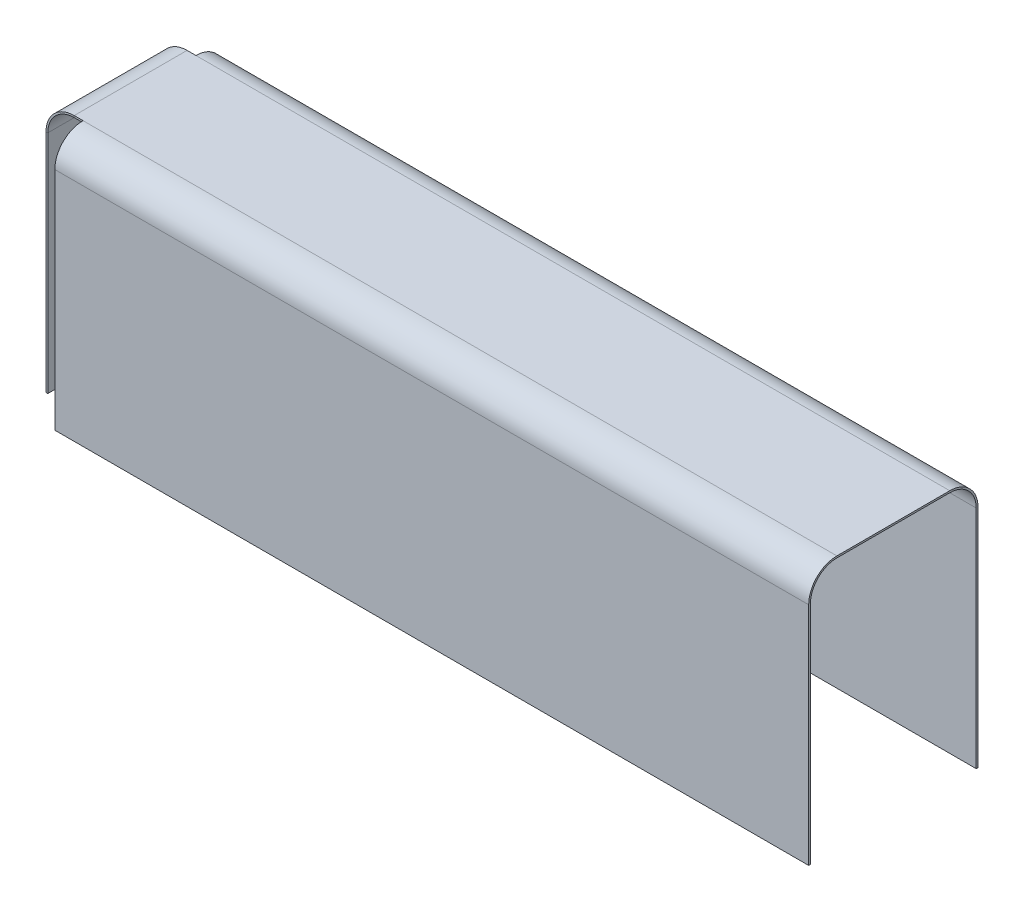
ISO-10303-21;
HEADER;
FILE_DESCRIPTION(('STEP AP214'),'2;1');
FILE_NAME('part.step','',(''),(''),'','','');
FILE_SCHEMA(('AUTOMOTIVE_DESIGN { 1 0 10303 214 1 1 1 1 }'));
ENDSEC;
DATA;
#1=APPLICATION_CONTEXT('core data for automotive mechanical design processes');
#2=APPLICATION_PROTOCOL_DEFINITION('international standard','automotive_design',2000,#1);
#3=PRODUCT_CONTEXT('',#1,'mechanical');
#4=PRODUCT('Part','Part','',(#3));
#5=PRODUCT_RELATED_PRODUCT_CATEGORY('part','',(#4));
#6=PRODUCT_DEFINITION_FORMATION('','',#4);
#7=PRODUCT_DEFINITION_CONTEXT('part definition',#1,'design');
#8=PRODUCT_DEFINITION('design','',#6,#7);
#9=PRODUCT_DEFINITION_SHAPE('','',#8);
#10=(LENGTH_UNIT() NAMED_UNIT(*) SI_UNIT(.MILLI.,.METRE.));
#11=(NAMED_UNIT(*) PLANE_ANGLE_UNIT() SI_UNIT($,.RADIAN.));
#12=(NAMED_UNIT(*) SI_UNIT($,.STERADIAN.) SOLID_ANGLE_UNIT());
#13=UNCERTAINTY_MEASURE_WITH_UNIT(LENGTH_MEASURE(1.E-05),#10,'distance_accuracy_value','');
#14=(GEOMETRIC_REPRESENTATION_CONTEXT(3) GLOBAL_UNCERTAINTY_ASSIGNED_CONTEXT((#13)) GLOBAL_UNIT_ASSIGNED_CONTEXT((#10,
#11,#12)) REPRESENTATION_CONTEXT('',''));
#15=CARTESIAN_POINT('',(0.,0.,0.));
#16=DIRECTION('',(0.,0.,1.));
#17=DIRECTION('',(1.,0.,0.));
#18=AXIS2_PLACEMENT_3D('',#15,#16,#17);
#19=CARTESIAN_POINT('',(-169.630725,114.3,38.1));
#20=DIRECTION('',(1.,0.,0.));
#21=DIRECTION('',(0.,0.,-1.));
#22=AXIS2_PLACEMENT_3D('',#19,#20,#21);
#23=PLANE('',#22);
#24=DIRECTION('',(0.,-1.,0.));
#25=VECTOR('',#24,1.);
#26=CARTESIAN_POINT('',(-169.630725,114.3,-25.4));
#27=LINE('',#26,#25);
#28=CARTESIAN_POINT('',(-169.630725,114.3,-25.4));
#29=VERTEX_POINT('',#28);
#30=CARTESIAN_POINT('',(-169.630725,113.50625,-25.4));
#31=VERTEX_POINT('',#30);
#32=EDGE_CURVE('E198',#29,#31,#27,.T.);
#33=ORIENTED_EDGE('',*,*,#32,.F.);
#34=CARTESIAN_POINT('',(-169.630725,101.6,-25.4));
#35=DIRECTION('',(1.,0.,0.));
#36=DIRECTION('',(0.,0.,-1.));
#37=AXIS2_PLACEMENT_3D('',#34,#35,#36);
#38=CIRCLE('',#37,12.7);
#39=CARTESIAN_POINT('',(-169.630725,101.6,-38.1));
#40=VERTEX_POINT('',#39);
#41=EDGE_CURVE('E315',#29,#40,#38,.F.);
#42=ORIENTED_EDGE('',*,*,#41,.T.);
#43=DIRECTION('',(0.,-1.,0.));
#44=VECTOR('',#43,1.);
#45=CARTESIAN_POINT('',(-169.630725,114.3,-38.1));
#46=LINE('',#45,#44);
#47=CARTESIAN_POINT('',(-169.630725,0.,-38.1));
#48=VERTEX_POINT('',#47);
#49=EDGE_CURVE('E285',#40,#48,#46,.T.);
#50=ORIENTED_EDGE('',*,*,#49,.T.);
#51=DIRECTION('',(0.,0.,1.));
#52=VECTOR('',#51,1.);
#53=CARTESIAN_POINT('',(-169.630725,0.,38.1));
#54=LINE('',#53,#52);
#55=CARTESIAN_POINT('',(-169.630725,0.,-37.30625));
#56=VERTEX_POINT('',#55);
#57=EDGE_CURVE('E287',#48,#56,#54,.T.);
#58=ORIENTED_EDGE('',*,*,#57,.T.);
#59=DIRECTION('',(0.,-1.,0.));
#60=VECTOR('',#59,1.);
#61=CARTESIAN_POINT('',(-169.630725,114.3,-37.30625));
#62=LINE('',#61,#60);
#63=CARTESIAN_POINT('',(-169.630725,101.6,-37.30625));
#64=VERTEX_POINT('',#63);
#65=EDGE_CURVE('E272',#64,#56,#62,.T.);
#66=ORIENTED_EDGE('',*,*,#65,.F.);
#67=CARTESIAN_POINT('',(-169.630725,101.6,-25.4));
#68=DIRECTION('',(1.,0.,0.));
#69=DIRECTION('',(0.,0.,-1.));
#70=AXIS2_PLACEMENT_3D('',#67,#68,#69);
#71=CIRCLE('',#70,11.90625);
#72=EDGE_CURVE('E262',#31,#64,#71,.F.);
#73=ORIENTED_EDGE('',*,*,#72,.F.);
#74=EDGE_LOOP('',(#33,#42,#50,#58,#66,#73));
#75=FACE_BOUND('',#74,.T.);
#76=ADVANCED_FACE('F33',(#75),#23,.F.);
#77=DIRECTION('',(0.,1.,0.));
#78=VECTOR('',#77,1.);
#79=CARTESIAN_POINT('',(-169.630725,114.3,25.4));
#80=LINE('',#79,#78);
#81=CARTESIAN_POINT('',(-169.630725,113.50625,25.4));
#82=VERTEX_POINT('',#81);
#83=CARTESIAN_POINT('',(-169.630725,114.3,25.4));
#84=VERTEX_POINT('',#83);
#85=EDGE_CURVE('E195',#82,#84,#80,.T.);
#86=ORIENTED_EDGE('',*,*,#85,.F.);
#87=CARTESIAN_POINT('',(-169.630725,101.6,25.4));
#88=DIRECTION('',(1.,0.,0.));
#89=DIRECTION('',(0.,0.,-1.));
#90=AXIS2_PLACEMENT_3D('',#87,#88,#89);
#91=CIRCLE('',#90,11.90625);
#92=CARTESIAN_POINT('',(-169.630725,101.6,37.30625));
#93=VERTEX_POINT('',#92);
#94=EDGE_CURVE('E258',#93,#82,#91,.F.);
#95=ORIENTED_EDGE('',*,*,#94,.F.);
#96=DIRECTION('',(0.,-1.,0.));
#97=VECTOR('',#96,1.);
#98=CARTESIAN_POINT('',(-169.630725,114.3,37.30625));
#99=LINE('',#98,#97);
#100=CARTESIAN_POINT('',(-169.630725,0.,37.30625));
#101=VERTEX_POINT('',#100);
#102=EDGE_CURVE('E256',#93,#101,#99,.T.);
#103=ORIENTED_EDGE('',*,*,#102,.T.);
#104=CARTESIAN_POINT('',(-169.630725,0.,38.1));
#105=VERTEX_POINT('',#104);
#106=EDGE_CURVE('E251',#101,#105,#54,.T.);
#107=ORIENTED_EDGE('',*,*,#106,.T.);
#108=DIRECTION('',(0.,-1.,0.));
#109=VECTOR('',#108,1.);
#110=CARTESIAN_POINT('',(-169.630725,114.3,38.1));
#111=LINE('',#110,#109);
#112=CARTESIAN_POINT('',(-169.630725,101.6,38.1));
#113=VERTEX_POINT('',#112);
#114=EDGE_CURVE('E305',#113,#105,#111,.T.);
#115=ORIENTED_EDGE('',*,*,#114,.F.);
#116=CARTESIAN_POINT('',(-169.630725,101.6,25.4));
#117=DIRECTION('',(1.,0.,0.));
#118=DIRECTION('',(0.,0.,-1.));
#119=AXIS2_PLACEMENT_3D('',#116,#117,#118);
#120=CIRCLE('',#119,12.7);
#121=EDGE_CURVE('E312',#113,#84,#120,.F.);
#122=ORIENTED_EDGE('',*,*,#121,.T.);
#123=EDGE_LOOP('',(#86,#95,#103,#107,#115,#122));
#124=FACE_BOUND('',#123,.T.);
#125=ADVANCED_FACE('F358',(#124),#23,.F.);
#126=CARTESIAN_POINT('',(0.,0.,0.));
#127=DIRECTION('',(0.,-1.,0.));
#128=DIRECTION('',(0.,0.,-1.));
#129=AXIS2_PLACEMENT_3D('',#126,#127,#128);
#130=PLANE('',#129);
#131=DIRECTION('',(0.,0.,-1.));
#132=VECTOR('',#131,1.);
#133=CARTESIAN_POINT('',(169.630725,0.,38.1));
#134=LINE('',#133,#132);
#135=CARTESIAN_POINT('',(169.630725,0.,-37.30625));
#136=VERTEX_POINT('',#135);
#137=CARTESIAN_POINT('',(169.630725,0.,-38.1));
#138=VERTEX_POINT('',#137);
#139=EDGE_CURVE('E293',#136,#138,#134,.T.);
#140=ORIENTED_EDGE('',*,*,#139,.F.);
#141=DIRECTION('',(-1.,0.,0.));
#142=VECTOR('',#141,1.);
#143=CARTESIAN_POINT('',(0.,0.,-37.30625));
#144=LINE('',#143,#142);
#145=EDGE_CURVE('E266',#136,#56,#144,.T.);
#146=ORIENTED_EDGE('',*,*,#145,.T.);
#147=ORIENTED_EDGE('',*,*,#57,.F.);
#148=DIRECTION('',(-1.,0.,0.));
#149=VECTOR('',#148,1.);
#150=CARTESIAN_POINT('',(-169.630725,0.,-38.1));
#151=LINE('',#150,#149);
#152=EDGE_CURVE('E286',#138,#48,#151,.T.);
#153=ORIENTED_EDGE('',*,*,#152,.F.);
#154=EDGE_LOOP('',(#140,#146,#147,#153));
#155=FACE_BOUND('',#154,.T.);
#156=ADVANCED_FACE('F336',(#155),#130,.T.);
#157=ORIENTED_EDGE('',*,*,#106,.F.);
#158=DIRECTION('',(1.,0.,0.));
#159=VECTOR('',#158,1.);
#160=CARTESIAN_POINT('',(0.,0.,37.30625));
#161=LINE('',#160,#159);
#162=CARTESIAN_POINT('',(169.630725,0.,37.30625));
#163=VERTEX_POINT('',#162);
#164=EDGE_CURVE('E248',#101,#163,#161,.T.);
#165=ORIENTED_EDGE('',*,*,#164,.T.);
#166=CARTESIAN_POINT('',(169.630725,0.,38.1));
#167=VERTEX_POINT('',#166);
#168=EDGE_CURVE('E294',#167,#163,#134,.T.);
#169=ORIENTED_EDGE('',*,*,#168,.F.);
#170=DIRECTION('',(1.,0.,0.));
#171=VECTOR('',#170,1.);
#172=CARTESIAN_POINT('',(-169.630725,0.,38.1));
#173=LINE('',#172,#171);
#174=EDGE_CURVE('E290',#105,#167,#173,.T.);
#175=ORIENTED_EDGE('',*,*,#174,.F.);
#176=EDGE_LOOP('',(#157,#165,#169,#175));
#177=FACE_BOUND('',#176,.T.);
#178=ADVANCED_FACE('F419',(#177),#130,.T.);
#179=CARTESIAN_POINT('',(-169.630725,114.3,38.1));
#180=DIRECTION('',(0.,0.,-1.));
#181=DIRECTION('',(-1.,0.,0.));
#182=AXIS2_PLACEMENT_3D('',#179,#180,#181);
#183=PLANE('',#182);
#184=DIRECTION('',(0.,-1.,0.));
#185=VECTOR('',#184,1.);
#186=CARTESIAN_POINT('',(169.630725,114.3,38.1));
#187=LINE('',#186,#185);
#188=CARTESIAN_POINT('',(169.630725,101.6,38.1));
#189=VERTEX_POINT('',#188);
#190=EDGE_CURVE('E303',#189,#167,#187,.T.);
#191=ORIENTED_EDGE('',*,*,#190,.F.);
#192=DIRECTION('',(1.,0.,0.));
#193=VECTOR('',#192,1.);
#194=CARTESIAN_POINT('',(-169.630725,101.6,38.1));
#195=LINE('',#194,#193);
#196=EDGE_CURVE('E11',#189,#113,#195,.F.);
#197=ORIENTED_EDGE('',*,*,#196,.T.);
#198=ORIENTED_EDGE('',*,*,#114,.T.);
#199=ORIENTED_EDGE('',*,*,#174,.T.);
#200=EDGE_LOOP('',(#191,#197,#198,#199));
#201=FACE_BOUND('',#200,.T.);
#202=ADVANCED_FACE('F403',(#201),#183,.F.);
#203=CARTESIAN_POINT('',(169.630725,114.3,38.1));
#204=DIRECTION('',(-1.,0.,0.));
#205=DIRECTION('',(0.,0.,1.));
#206=AXIS2_PLACEMENT_3D('',#203,#204,#205);
#207=PLANE('',#206);
#208=CARTESIAN_POINT('',(169.630725,101.6,-25.4));
#209=DIRECTION('',(-1.,0.,0.));
#210=DIRECTION('',(0.,0.,1.));
#211=AXIS2_PLACEMENT_3D('',#208,#209,#210);
#212=CIRCLE('',#211,11.90625);
#213=CARTESIAN_POINT('',(169.630725,101.6,-37.30625));
#214=VERTEX_POINT('',#213);
#215=CARTESIAN_POINT('',(169.630725,113.50625,-25.4));
#216=VERTEX_POINT('',#215);
#217=EDGE_CURVE('E252',#214,#216,#212,.F.);
#218=ORIENTED_EDGE('',*,*,#217,.F.);
#219=DIRECTION('',(0.,-1.,0.));
#220=VECTOR('',#219,1.);
#221=CARTESIAN_POINT('',(169.630725,114.3,-37.30625));
#222=LINE('',#221,#220);
#223=EDGE_CURVE('E264',#214,#136,#222,.T.);
#224=ORIENTED_EDGE('',*,*,#223,.T.);
#225=ORIENTED_EDGE('',*,*,#139,.T.);
#226=DIRECTION('',(0.,-1.,0.));
#227=VECTOR('',#226,1.);
#228=CARTESIAN_POINT('',(169.630725,114.3,-38.1));
#229=LINE('',#228,#227);
#230=CARTESIAN_POINT('',(169.630725,101.6,-38.1));
#231=VERTEX_POINT('',#230);
#232=EDGE_CURVE('E300',#231,#138,#229,.T.);
#233=ORIENTED_EDGE('',*,*,#232,.F.);
#234=CARTESIAN_POINT('',(169.630725,101.6,-25.4));
#235=DIRECTION('',(-1.,0.,0.));
#236=DIRECTION('',(0.,0.,1.));
#237=AXIS2_PLACEMENT_3D('',#234,#235,#236);
#238=CIRCLE('',#237,12.7);
#239=CARTESIAN_POINT('',(169.630725,114.3,-25.4));
#240=VERTEX_POINT('',#239);
#241=EDGE_CURVE('E41',#231,#240,#238,.F.);
#242=ORIENTED_EDGE('',*,*,#241,.T.);
#243=DIRECTION('',(0.,0.,-1.));
#244=VECTOR('',#243,1.);
#245=CARTESIAN_POINT('',(169.630725,114.3,38.1));
#246=LINE('',#245,#244);
#247=CARTESIAN_POINT('',(169.630725,114.3,25.4));
#248=VERTEX_POINT('',#247);
#249=EDGE_CURVE('E283',#248,#240,#246,.T.);
#250=ORIENTED_EDGE('',*,*,#249,.F.);
#251=CARTESIAN_POINT('',(169.630725,101.6,25.4));
#252=DIRECTION('',(-1.,0.,0.));
#253=DIRECTION('',(0.,0.,1.));
#254=AXIS2_PLACEMENT_3D('',#251,#252,#253);
#255=CIRCLE('',#254,12.7);
#256=EDGE_CURVE('E56',#248,#189,#255,.F.);
#257=ORIENTED_EDGE('',*,*,#256,.T.);
#258=ORIENTED_EDGE('',*,*,#190,.T.);
#259=ORIENTED_EDGE('',*,*,#168,.T.);
#260=DIRECTION('',(0.,-1.,0.));
#261=VECTOR('',#260,1.);
#262=CARTESIAN_POINT('',(169.630725,114.3,37.30625));
#263=LINE('',#262,#261);
#264=CARTESIAN_POINT('',(169.630725,101.6,37.30625));
#265=VERTEX_POINT('',#264);
#266=EDGE_CURVE('E48',#265,#163,#263,.T.);
#267=ORIENTED_EDGE('',*,*,#266,.F.);
#268=CARTESIAN_POINT('',(169.630725,101.6,25.4));
#269=DIRECTION('',(-1.,0.,0.));
#270=DIRECTION('',(0.,0.,1.));
#271=AXIS2_PLACEMENT_3D('',#268,#269,#270);
#272=CIRCLE('',#271,11.90625);
#273=CARTESIAN_POINT('',(169.630725,113.50625,25.4));
#274=VERTEX_POINT('',#273);
#275=EDGE_CURVE('E261',#274,#265,#272,.F.);
#276=ORIENTED_EDGE('',*,*,#275,.F.);
#277=DIRECTION('',(0.,0.,-1.));
#278=VECTOR('',#277,1.);
#279=CARTESIAN_POINT('',(169.630725,113.50625,0.));
#280=LINE('',#279,#278);
#281=EDGE_CURVE('E274',#274,#216,#280,.T.);
#282=ORIENTED_EDGE('',*,*,#281,.T.);
#283=EDGE_LOOP('',(#218,#224,#225,#233,#242,#250,#257,#258,#259,#267,#276,#282));
#284=FACE_BOUND('',#283,.T.);
#285=ADVANCED_FACE('F322',(#284),#207,.F.);
#286=CARTESIAN_POINT('',(-169.630725,114.3,-38.1));
#287=DIRECTION('',(0.,0.,1.));
#288=DIRECTION('',(1.,0.,0.));
#289=AXIS2_PLACEMENT_3D('',#286,#287,#288);
#290=PLANE('',#289);
#291=ORIENTED_EDGE('',*,*,#49,.F.);
#292=DIRECTION('',(-1.,0.,0.));
#293=VECTOR('',#292,1.);
#294=CARTESIAN_POINT('',(-169.630725,101.6,-38.1));
#295=LINE('',#294,#293);
#296=EDGE_CURVE('E317',#40,#231,#295,.F.);
#297=ORIENTED_EDGE('',*,*,#296,.T.);
#298=ORIENTED_EDGE('',*,*,#232,.T.);
#299=ORIENTED_EDGE('',*,*,#152,.T.);
#300=EDGE_LOOP('',(#291,#297,#298,#299));
#301=FACE_BOUND('',#300,.T.);
#302=ADVANCED_FACE('F331',(#301),#290,.F.);
#303=CARTESIAN_POINT('',(0.,114.3,0.));
#304=DIRECTION('',(0.,-1.,0.));
#305=DIRECTION('',(0.,0.,-1.));
#306=AXIS2_PLACEMENT_3D('',#303,#304,#305);
#307=PLANE('',#306);
#308=ORIENTED_EDGE('',*,*,#249,.T.);
#309=DIRECTION('',(-1.,0.,0.));
#310=VECTOR('',#309,1.);
#311=CARTESIAN_POINT('',(0.,114.3,-25.4));
#312=LINE('',#311,#310);
#313=EDGE_CURVE('E194',#240,#29,#312,.T.);
#314=ORIENTED_EDGE('',*,*,#313,.T.);
#315=DIRECTION('',(-1.,0.,0.));
#316=VECTOR('',#315,1.);
#317=CARTESIAN_POINT('',(-169.630725,114.3,-25.4));
#318=LINE('',#317,#316);
#319=CARTESIAN_POINT('',(-173.599475,114.3,-25.4));
#320=VERTEX_POINT('',#319);
#321=EDGE_CURVE('E186',#29,#320,#318,.T.);
#322=ORIENTED_EDGE('',*,*,#321,.T.);
#323=DIRECTION('',(0.,0.,-1.));
#324=VECTOR('',#323,1.);
#325=CARTESIAN_POINT('',(-173.599475,114.3,-25.4));
#326=LINE('',#325,#324);
#327=CARTESIAN_POINT('',(-173.599475,114.3,25.4));
#328=VERTEX_POINT('',#327);
#329=EDGE_CURVE('E169',#328,#320,#326,.T.);
#330=ORIENTED_EDGE('',*,*,#329,.F.);
#331=DIRECTION('',(-1.,0.,0.));
#332=VECTOR('',#331,1.);
#333=CARTESIAN_POINT('',(-169.630725,114.3,25.4));
#334=LINE('',#333,#332);
#335=EDGE_CURVE('E179',#84,#328,#334,.T.);
#336=ORIENTED_EDGE('',*,*,#335,.F.);
#337=DIRECTION('',(1.,0.,0.));
#338=VECTOR('',#337,1.);
#339=CARTESIAN_POINT('',(0.,114.3,25.4));
#340=LINE('',#339,#338);
#341=EDGE_CURVE('E308',#84,#248,#340,.T.);
#342=ORIENTED_EDGE('',*,*,#341,.T.);
#343=EDGE_LOOP('',(#308,#314,#322,#330,#336,#342));
#344=FACE_BOUND('',#343,.T.);
#345=ADVANCED_FACE('F192',(#344),#307,.F.);
#346=CARTESIAN_POINT('',(0.,101.6,-25.4));
#347=DIRECTION('',(-1.,0.,0.));
#348=DIRECTION('',(0.,0.,1.));
#349=AXIS2_PLACEMENT_3D('',#346,#347,#348);
#350=CYLINDRICAL_SURFACE('',#349,12.7);
#351=ORIENTED_EDGE('',*,*,#241,.F.);
#352=ORIENTED_EDGE('',*,*,#296,.F.);
#353=ORIENTED_EDGE('',*,*,#41,.F.);
#354=ORIENTED_EDGE('',*,*,#313,.F.);
#355=EDGE_LOOP('',(#351,#352,#353,#354));
#356=FACE_BOUND('',#355,.T.);
#357=ADVANCED_FACE('F326',(#356),#350,.T.);
#358=CARTESIAN_POINT('',(0.,101.6,25.4));
#359=DIRECTION('',(1.,0.,0.));
#360=DIRECTION('',(0.,0.,-1.));
#361=AXIS2_PLACEMENT_3D('',#358,#359,#360);
#362=CYLINDRICAL_SURFACE('',#361,12.7);
#363=ORIENTED_EDGE('',*,*,#121,.F.);
#364=ORIENTED_EDGE('',*,*,#196,.F.);
#365=ORIENTED_EDGE('',*,*,#256,.F.);
#366=ORIENTED_EDGE('',*,*,#341,.F.);
#367=EDGE_LOOP('',(#363,#364,#365,#366));
#368=FACE_BOUND('',#367,.T.);
#369=ADVANCED_FACE('F35',(#368),#362,.T.);
#370=CARTESIAN_POINT('',(-169.630725,114.3,37.30625));
#371=DIRECTION('',(0.,0.,-1.));
#372=DIRECTION('',(-1.,0.,0.));
#373=AXIS2_PLACEMENT_3D('',#370,#371,#372);
#374=PLANE('',#373);
#375=ORIENTED_EDGE('',*,*,#266,.T.);
#376=ORIENTED_EDGE('',*,*,#164,.F.);
#377=ORIENTED_EDGE('',*,*,#102,.F.);
#378=DIRECTION('',(-1.,0.,0.));
#379=VECTOR('',#378,1.);
#380=CARTESIAN_POINT('',(-169.630725,101.6,37.30625));
#381=LINE('',#380,#379);
#382=EDGE_CURVE('E249',#265,#93,#381,.T.);
#383=ORIENTED_EDGE('',*,*,#382,.F.);
#384=EDGE_LOOP('',(#375,#376,#377,#383));
#385=FACE_BOUND('',#384,.T.);
#386=ADVANCED_FACE('F354',(#385),#374,.T.);
#387=CARTESIAN_POINT('',(-169.630725,114.3,-37.30625));
#388=DIRECTION('',(0.,0.,1.));
#389=DIRECTION('',(1.,0.,0.));
#390=AXIS2_PLACEMENT_3D('',#387,#388,#389);
#391=PLANE('',#390);
#392=ORIENTED_EDGE('',*,*,#65,.T.);
#393=ORIENTED_EDGE('',*,*,#145,.F.);
#394=ORIENTED_EDGE('',*,*,#223,.F.);
#395=DIRECTION('',(1.,0.,0.));
#396=VECTOR('',#395,1.);
#397=CARTESIAN_POINT('',(-169.630725,101.6,-37.30625));
#398=LINE('',#397,#396);
#399=EDGE_CURVE('E259',#64,#214,#398,.T.);
#400=ORIENTED_EDGE('',*,*,#399,.F.);
#401=EDGE_LOOP('',(#392,#393,#394,#400));
#402=FACE_BOUND('',#401,.T.);
#403=ADVANCED_FACE('F340',(#402),#391,.T.);
#404=CARTESIAN_POINT('',(0.,113.50625,0.));
#405=DIRECTION('',(0.,-1.,0.));
#406=DIRECTION('',(0.,0.,-1.));
#407=AXIS2_PLACEMENT_3D('',#404,#405,#406);
#408=PLANE('',#407);
#409=ORIENTED_EDGE('',*,*,#281,.F.);
#410=DIRECTION('',(1.,0.,0.));
#411=VECTOR('',#410,1.);
#412=CARTESIAN_POINT('',(0.,113.50625,25.4));
#413=LINE('',#412,#411);
#414=EDGE_CURVE('E253',#82,#274,#413,.T.);
#415=ORIENTED_EDGE('',*,*,#414,.F.);
#416=DIRECTION('',(-1.,0.,0.));
#417=VECTOR('',#416,1.);
#418=CARTESIAN_POINT('',(-169.630725,113.50625,25.4));
#419=LINE('',#418,#417);
#420=CARTESIAN_POINT('',(-173.599475,113.50625,25.4));
#421=VERTEX_POINT('',#420);
#422=EDGE_CURVE('E219',#82,#421,#419,.T.);
#423=ORIENTED_EDGE('',*,*,#422,.T.);
#424=DIRECTION('',(0.,0.,1.));
#425=VECTOR('',#424,1.);
#426=CARTESIAN_POINT('',(-173.599475,113.50625,-25.4));
#427=LINE('',#426,#425);
#428=CARTESIAN_POINT('',(-173.599475,113.50625,-25.4));
#429=VERTEX_POINT('',#428);
#430=EDGE_CURVE('E216',#429,#421,#427,.T.);
#431=ORIENTED_EDGE('',*,*,#430,.F.);
#432=DIRECTION('',(-1.,0.,0.));
#433=VECTOR('',#432,1.);
#434=CARTESIAN_POINT('',(-169.630725,113.50625,-25.4));
#435=LINE('',#434,#433);
#436=EDGE_CURVE('E188',#31,#429,#435,.T.);
#437=ORIENTED_EDGE('',*,*,#436,.F.);
#438=DIRECTION('',(1.,0.,0.));
#439=VECTOR('',#438,1.);
#440=CARTESIAN_POINT('',(0.,113.50625,-25.4));
#441=LINE('',#440,#439);
#442=EDGE_CURVE('E255',#216,#31,#441,.F.);
#443=ORIENTED_EDGE('',*,*,#442,.F.);
#444=EDGE_LOOP('',(#409,#415,#423,#431,#437,#443));
#445=FACE_BOUND('',#444,.T.);
#446=ADVANCED_FACE('F347',(#445),#408,.T.);
#447=CARTESIAN_POINT('',(0.,101.6,-25.4));
#448=DIRECTION('',(-1.,0.,0.));
#449=DIRECTION('',(0.,0.,1.));
#450=AXIS2_PLACEMENT_3D('',#447,#448,#449);
#451=CYLINDRICAL_SURFACE('',#450,11.90625);
#452=ORIENTED_EDGE('',*,*,#217,.T.);
#453=ORIENTED_EDGE('',*,*,#442,.T.);
#454=ORIENTED_EDGE('',*,*,#72,.T.);
#455=ORIENTED_EDGE('',*,*,#399,.T.);
#456=EDGE_LOOP('',(#452,#453,#454,#455));
#457=FACE_BOUND('',#456,.T.);
#458=ADVANCED_FACE('F343',(#457),#451,.F.);
#459=CARTESIAN_POINT('',(0.,101.6,25.4));
#460=DIRECTION('',(1.,0.,0.));
#461=DIRECTION('',(0.,0.,-1.));
#462=AXIS2_PLACEMENT_3D('',#459,#460,#461);
#463=CYLINDRICAL_SURFACE('',#462,11.90625);
#464=ORIENTED_EDGE('',*,*,#94,.T.);
#465=ORIENTED_EDGE('',*,*,#414,.T.);
#466=ORIENTED_EDGE('',*,*,#275,.T.);
#467=ORIENTED_EDGE('',*,*,#382,.T.);
#468=EDGE_LOOP('',(#464,#465,#466,#467));
#469=FACE_BOUND('',#468,.T.);
#470=ADVANCED_FACE('F352',(#469),#463,.F.);
#471=CARTESIAN_POINT('',(-71.999475,8.04911692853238E-13,0.));
#472=DIRECTION('',(0.,-1.,0.));
#473=DIRECTION('',(0.,0.,1.));
#474=AXIS2_PLACEMENT_3D('',#471,#472,#473);
#475=PLANE('',#474);
#476=DIRECTION('',(1.,0.,0.));
#477=VECTOR('',#476,1.);
#478=CARTESIAN_POINT('',(-186.299475,0.,-25.4));
#479=LINE('',#478,#477);
#480=CARTESIAN_POINT('',(-186.299475,0.,-25.4));
#481=VERTEX_POINT('',#480);
#482=CARTESIAN_POINT('',(-185.505725,0.,-25.4));
#483=VERTEX_POINT('',#482);
#484=EDGE_CURVE('E206',#481,#483,#479,.T.);
#485=ORIENTED_EDGE('',*,*,#484,.T.);
#486=DIRECTION('',(0.,0.,1.));
#487=VECTOR('',#486,1.);
#488=CARTESIAN_POINT('',(-185.505725,0.,-25.4));
#489=LINE('',#488,#487);
#490=CARTESIAN_POINT('',(-185.505725,0.,25.4));
#491=VERTEX_POINT('',#490);
#492=EDGE_CURVE('E212',#483,#491,#489,.T.);
#493=ORIENTED_EDGE('',*,*,#492,.T.);
#494=DIRECTION('',(-1.,0.,0.));
#495=VECTOR('',#494,1.);
#496=CARTESIAN_POINT('',(-186.299475,0.,25.4));
#497=LINE('',#496,#495);
#498=CARTESIAN_POINT('',(-186.299475,0.,25.4));
#499=VERTEX_POINT('',#498);
#500=EDGE_CURVE('E232',#491,#499,#497,.T.);
#501=ORIENTED_EDGE('',*,*,#500,.T.);
#502=DIRECTION('',(0.,0.,-1.));
#503=VECTOR('',#502,1.);
#504=CARTESIAN_POINT('',(-186.299475,0.,-25.4));
#505=LINE('',#504,#503);
#506=EDGE_CURVE('E243',#499,#481,#505,.T.);
#507=ORIENTED_EDGE('',*,*,#506,.T.);
#508=EDGE_LOOP('',(#485,#493,#501,#507));
#509=FACE_BOUND('',#508,.T.);
#510=ADVANCED_FACE('F382',(#509),#475,.T.);
#511=CARTESIAN_POINT('',(-169.630725,114.3,-25.4));
#512=DIRECTION('',(0.,0.,-1.));
#513=DIRECTION('',(-1.,0.,0.));
#514=AXIS2_PLACEMENT_3D('',#511,#512,#513);
#515=PLANE('',#514);
#516=ORIENTED_EDGE('',*,*,#436,.T.);
#517=DIRECTION('',(0.,-1.,0.));
#518=VECTOR('',#517,1.);
#519=CARTESIAN_POINT('',(-173.599475,114.3,-25.4));
#520=LINE('',#519,#518);
#521=EDGE_CURVE('E164',#320,#429,#520,.T.);
#522=ORIENTED_EDGE('',*,*,#521,.F.);
#523=ORIENTED_EDGE('',*,*,#321,.F.);
#524=ORIENTED_EDGE('',*,*,#32,.T.);
#525=EDGE_LOOP('',(#516,#522,#523,#524));
#526=FACE_BOUND('',#525,.T.);
#527=ADVANCED_FACE('F184',(#526),#515,.T.);
#528=CARTESIAN_POINT('',(-169.630725,114.3,25.4));
#529=DIRECTION('',(0.,0.,1.));
#530=DIRECTION('',(0.,-1.,0.));
#531=AXIS2_PLACEMENT_3D('',#528,#529,#530);
#532=PLANE('',#531);
#533=ORIENTED_EDGE('',*,*,#335,.T.);
#534=DIRECTION('',(0.,1.,0.));
#535=VECTOR('',#534,1.);
#536=CARTESIAN_POINT('',(-173.599475,114.3,25.4));
#537=LINE('',#536,#535);
#538=EDGE_CURVE('E222',#421,#328,#537,.T.);
#539=ORIENTED_EDGE('',*,*,#538,.F.);
#540=ORIENTED_EDGE('',*,*,#422,.F.);
#541=ORIENTED_EDGE('',*,*,#85,.T.);
#542=EDGE_LOOP('',(#533,#539,#540,#541));
#543=FACE_BOUND('',#542,.T.);
#544=ADVANCED_FACE('F362',(#543),#532,.T.);
#545=CARTESIAN_POINT('',(-173.599474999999,114.300000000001,-25.4));
#546=DIRECTION('',(0.,0.,-1.));
#547=DIRECTION('',(-1.,0.,0.));
#548=AXIS2_PLACEMENT_3D('',#545,#546,#547);
#549=PLANE('',#548);
#550=CARTESIAN_POINT('',(-173.599475,101.6,-25.4));
#551=DIRECTION('',(0.,0.,1.));
#552=DIRECTION('',(0.,1.,0.));
#553=AXIS2_PLACEMENT_3D('',#550,#551,#552);
#554=CIRCLE('',#553,11.9062500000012);
#555=CARTESIAN_POINT('',(-185.505725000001,101.6,-25.4));
#556=VERTEX_POINT('',#555);
#557=EDGE_CURVE('E203',#429,#556,#554,.T.);
#558=ORIENTED_EDGE('',*,*,#557,.T.);
#559=DIRECTION('',(1.,0.,0.));
#560=VECTOR('',#559,1.);
#561=CARTESIAN_POINT('',(-186.299475,101.6,-25.4));
#562=LINE('',#561,#560);
#563=CARTESIAN_POINT('',(-186.299475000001,101.6,-25.4));
#564=VERTEX_POINT('',#563);
#565=EDGE_CURVE('E166',#564,#556,#562,.T.);
#566=ORIENTED_EDGE('',*,*,#565,.F.);
#567=CARTESIAN_POINT('',(-173.599475,101.6,-25.4));
#568=DIRECTION('',(0.,0.,1.));
#569=DIRECTION('',(0.,1.,0.));
#570=AXIS2_PLACEMENT_3D('',#567,#568,#569);
#571=CIRCLE('',#570,12.7000000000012);
#572=EDGE_CURVE('E159',#320,#564,#571,.T.);
#573=ORIENTED_EDGE('',*,*,#572,.F.);
#574=ORIENTED_EDGE('',*,*,#521,.T.);
#575=EDGE_LOOP('',(#558,#566,#573,#574));
#576=FACE_BOUND('',#575,.T.);
#577=ADVANCED_FACE('F162',(#576),#549,.T.);
#578=CARTESIAN_POINT('',(-173.599475,101.6,0.));
#579=DIRECTION('',(0.,0.,1.));
#580=DIRECTION('',(1.,0.,0.));
#581=AXIS2_PLACEMENT_3D('',#578,#579,#580);
#582=CYLINDRICAL_SURFACE('',#581,11.9062500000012);
#583=CARTESIAN_POINT('',(-173.599475,101.6,25.4));
#584=DIRECTION('',(0.,0.,1.));
#585=DIRECTION('',(0.,1.,0.));
#586=AXIS2_PLACEMENT_3D('',#583,#584,#585);
#587=CIRCLE('',#586,11.9062500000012);
#588=CARTESIAN_POINT('',(-185.505725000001,101.6,25.4));
#589=VERTEX_POINT('',#588);
#590=EDGE_CURVE('E225',#421,#589,#587,.T.);
#591=ORIENTED_EDGE('',*,*,#590,.T.);
#592=DIRECTION('',(0.,0.,1.));
#593=VECTOR('',#592,1.);
#594=CARTESIAN_POINT('',(-185.505725,101.6,-25.4));
#595=LINE('',#594,#593);
#596=EDGE_CURVE('E204',#556,#589,#595,.T.);
#597=ORIENTED_EDGE('',*,*,#596,.F.);
#598=ORIENTED_EDGE('',*,*,#557,.F.);
#599=ORIENTED_EDGE('',*,*,#430,.T.);
#600=EDGE_LOOP('',(#591,#597,#598,#599));
#601=FACE_BOUND('',#600,.T.);
#602=ADVANCED_FACE('F368',(#601),#582,.F.);
#603=CARTESIAN_POINT('',(-173.599474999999,114.300000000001,25.4));
#604=DIRECTION('',(0.,0.,1.));
#605=DIRECTION('',(1.,0.,0.));
#606=AXIS2_PLACEMENT_3D('',#603,#604,#605);
#607=PLANE('',#606);
#608=CARTESIAN_POINT('',(-173.599475,101.6,25.4));
#609=DIRECTION('',(0.,0.,1.));
#610=DIRECTION('',(0.,1.,0.));
#611=AXIS2_PLACEMENT_3D('',#608,#609,#610);
#612=CIRCLE('',#611,12.7000000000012);
#613=CARTESIAN_POINT('',(-186.299475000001,101.6,25.4));
#614=VERTEX_POINT('',#613);
#615=EDGE_CURVE('E174',#328,#614,#612,.T.);
#616=ORIENTED_EDGE('',*,*,#615,.T.);
#617=DIRECTION('',(-1.,0.,0.));
#618=VECTOR('',#617,1.);
#619=CARTESIAN_POINT('',(-186.299475,101.6,25.4));
#620=LINE('',#619,#618);
#621=EDGE_CURVE('E228',#589,#614,#620,.T.);
#622=ORIENTED_EDGE('',*,*,#621,.F.);
#623=ORIENTED_EDGE('',*,*,#590,.F.);
#624=ORIENTED_EDGE('',*,*,#538,.T.);
#625=EDGE_LOOP('',(#616,#622,#623,#624));
#626=FACE_BOUND('',#625,.T.);
#627=ADVANCED_FACE('F364',(#626),#607,.T.);
#628=CARTESIAN_POINT('',(-173.599475,101.6,0.));
#629=DIRECTION('',(0.,0.,1.));
#630=DIRECTION('',(1.,0.,0.));
#631=AXIS2_PLACEMENT_3D('',#628,#629,#630);
#632=CYLINDRICAL_SURFACE('',#631,12.7000000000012);
#633=DIRECTION('',(0.,0.,-1.));
#634=VECTOR('',#633,1.);
#635=CARTESIAN_POINT('',(-186.299475,101.6,-25.4));
#636=LINE('',#635,#634);
#637=EDGE_CURVE('E215',#614,#564,#636,.T.);
#638=ORIENTED_EDGE('',*,*,#637,.F.);
#639=ORIENTED_EDGE('',*,*,#615,.F.);
#640=ORIENTED_EDGE('',*,*,#329,.T.);
#641=ORIENTED_EDGE('',*,*,#572,.T.);
#642=EDGE_LOOP('',(#638,#639,#640,#641));
#643=FACE_BOUND('',#642,.T.);
#644=ADVANCED_FACE('F172',(#643),#632,.T.);
#645=CARTESIAN_POINT('',(-186.299475,101.6,-25.4));
#646=DIRECTION('',(0.,0.,-1.));
#647=DIRECTION('',(-1.,0.,0.));
#648=AXIS2_PLACEMENT_3D('',#645,#646,#647);
#649=PLANE('',#648);
#650=DIRECTION('',(0.,-1.,0.));
#651=VECTOR('',#650,1.);
#652=CARTESIAN_POINT('',(-185.505725,101.6,-25.4));
#653=LINE('',#652,#651);
#654=EDGE_CURVE('E208',#556,#483,#653,.T.);
#655=ORIENTED_EDGE('',*,*,#654,.T.);
#656=ORIENTED_EDGE('',*,*,#484,.F.);
#657=DIRECTION('',(0.,-1.,0.));
#658=VECTOR('',#657,1.);
#659=CARTESIAN_POINT('',(-186.299475,101.6,-25.4));
#660=LINE('',#659,#658);
#661=EDGE_CURVE('E209',#564,#481,#660,.T.);
#662=ORIENTED_EDGE('',*,*,#661,.F.);
#663=ORIENTED_EDGE('',*,*,#565,.T.);
#664=EDGE_LOOP('',(#655,#656,#662,#663));
#665=FACE_BOUND('',#664,.T.);
#666=ADVANCED_FACE('F374',(#665),#649,.T.);
#667=CARTESIAN_POINT('',(-185.505725,101.6,-25.4));
#668=DIRECTION('',(1.,0.,0.));
#669=DIRECTION('',(0.,0.,-1.));
#670=AXIS2_PLACEMENT_3D('',#667,#668,#669);
#671=PLANE('',#670);
#672=CARTESIAN_POINT('',(-185.505725,22.5425,0.));
#673=DIRECTION('',(1.,0.,0.));
#674=DIRECTION('',(0.,0.,-1.));
#675=AXIS2_PLACEMENT_3D('',#672,#673,#674);
#676=CIRCLE('',#675,2.54);
#677=CARTESIAN_POINT('',(-185.505725,22.5425,-2.54));
#678=VERTEX_POINT('',#677);
#679=EDGE_CURVE('E578',#678,#678,#676,.T.);
#680=ORIENTED_EDGE('',*,*,#679,.F.);
#681=EDGE_LOOP('',(#680));
#682=FACE_BOUND('',#681,.T.);
#683=DIRECTION('',(0.,-1.,0.));
#684=VECTOR('',#683,1.);
#685=CARTESIAN_POINT('',(-185.505725,101.6,25.4));
#686=LINE('',#685,#684);
#687=EDGE_CURVE('E230',#589,#491,#686,.T.);
#688=ORIENTED_EDGE('',*,*,#687,.T.);
#689=ORIENTED_EDGE('',*,*,#492,.F.);
#690=ORIENTED_EDGE('',*,*,#654,.F.);
#691=ORIENTED_EDGE('',*,*,#596,.T.);
#692=EDGE_LOOP('',(#688,#689,#690,#691));
#693=FACE_BOUND('',#692,.T.);
#694=ADVANCED_FACE('F370',(#682,#693),#671,.T.);
#695=CARTESIAN_POINT('',(-186.299475,101.6,25.4));
#696=DIRECTION('',(0.,0.,1.));
#697=DIRECTION('',(1.,0.,0.));
#698=AXIS2_PLACEMENT_3D('',#695,#696,#697);
#699=PLANE('',#698);
#700=DIRECTION('',(0.,-1.,0.));
#701=VECTOR('',#700,1.);
#702=CARTESIAN_POINT('',(-186.299475,101.6,25.4));
#703=LINE('',#702,#701);
#704=EDGE_CURVE('E241',#614,#499,#703,.T.);
#705=ORIENTED_EDGE('',*,*,#704,.T.);
#706=ORIENTED_EDGE('',*,*,#500,.F.);
#707=ORIENTED_EDGE('',*,*,#687,.F.);
#708=ORIENTED_EDGE('',*,*,#621,.T.);
#709=EDGE_LOOP('',(#705,#706,#707,#708));
#710=FACE_BOUND('',#709,.T.);
#711=ADVANCED_FACE('F380',(#710),#699,.T.);
#712=CARTESIAN_POINT('',(-186.299475,101.6,-25.4));
#713=DIRECTION('',(-1.,0.,0.));
#714=DIRECTION('',(0.,0.,1.));
#715=AXIS2_PLACEMENT_3D('',#712,#713,#714);
#716=PLANE('',#715);
#717=CARTESIAN_POINT('',(-186.299475,22.5425,0.));
#718=DIRECTION('',(-1.,0.,0.));
#719=DIRECTION('',(0.,0.,1.));
#720=AXIS2_PLACEMENT_3D('',#717,#718,#719);
#721=CIRCLE('',#720,2.54);
#722=CARTESIAN_POINT('',(-186.299475,22.5425,2.54));
#723=VERTEX_POINT('',#722);
#724=EDGE_CURVE('E576',#723,#723,#721,.T.);
#725=ORIENTED_EDGE('',*,*,#724,.F.);
#726=EDGE_LOOP('',(#725));
#727=FACE_BOUND('',#726,.T.);
#728=ORIENTED_EDGE('',*,*,#506,.F.);
#729=ORIENTED_EDGE('',*,*,#704,.F.);
#730=ORIENTED_EDGE('',*,*,#637,.T.);
#731=ORIENTED_EDGE('',*,*,#661,.T.);
#732=EDGE_LOOP('',(#728,#729,#730,#731));
#733=FACE_BOUND('',#732,.T.);
#734=ADVANCED_FACE('F377',(#727,#733),#716,.T.);
#735=CARTESIAN_POINT('',(-183.759475,22.5425,0.));
#736=DIRECTION('',(-1.,0.,0.));
#737=DIRECTION('',(0.,0.,1.));
#738=AXIS2_PLACEMENT_3D('',#735,#736,#737);
#739=CYLINDRICAL_SURFACE('',#738,2.54);
#740=ORIENTED_EDGE('',*,*,#679,.T.);
#741=EDGE_LOOP('',(#740));
#742=FACE_BOUND('',#741,.T.);
#743=ORIENTED_EDGE('',*,*,#724,.T.);
#744=EDGE_LOOP('',(#743));
#745=FACE_BOUND('',#744,.T.);
#746=ADVANCED_FACE('F385',(#742,#745),#739,.F.);
#747=CLOSED_SHELL('',(#76,#125,#156,#178,#202,#285,#302,#345,#357,#369,#386,#403,#446,#458,#470,
#510,#527,#544,#577,#602,#627,#644,#666,#694,#711,#734,#746));
#748=MANIFOLD_SOLID_BREP('B2',#747);
#749=ADVANCED_BREP_SHAPE_REPRESENTATION('',(#18,#748),#14);
#750=SHAPE_DEFINITION_REPRESENTATION(#9,#749);
ENDSEC;
END-ISO-10303-21;
